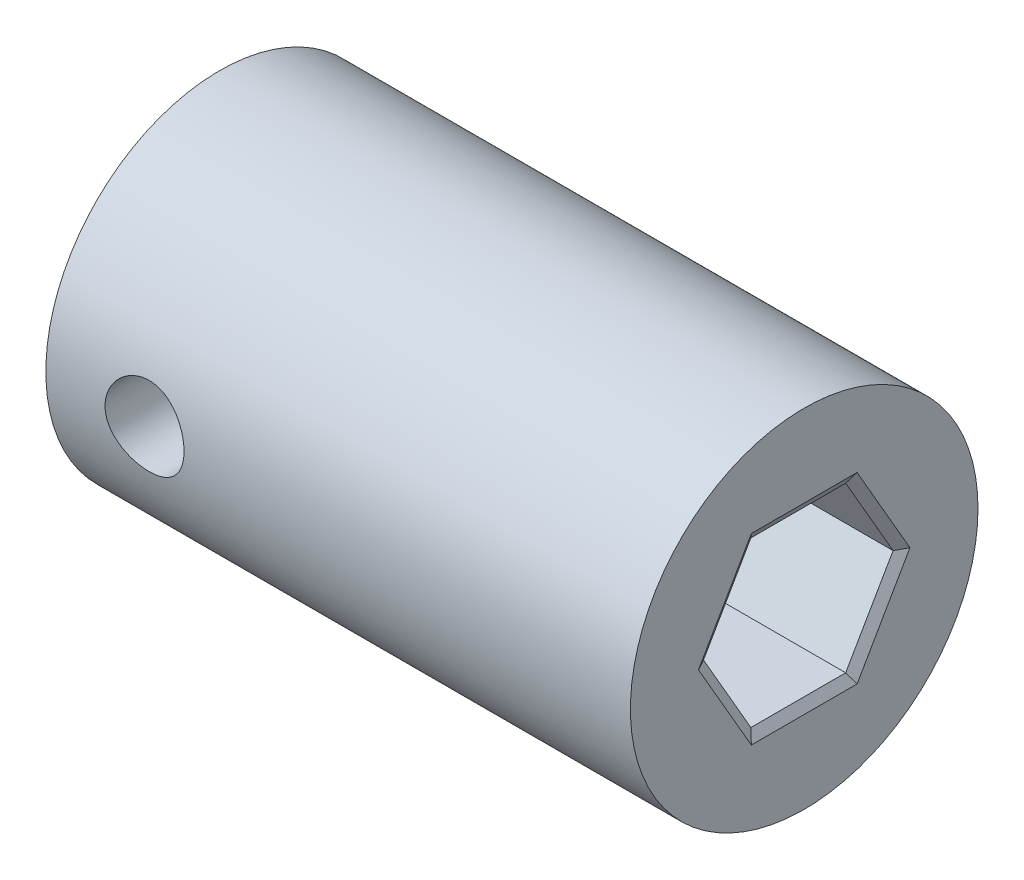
from build123d import *

# Parameters (mm, degrees)
SKETCH1_R               = 11
SKETCH1_R_2             = 3.9
BOSS_EXTRUDE1_DEPTH     = 37
CHAMFER2_SIZE           = 1.2
CHAMFER2_SIZE2          = 0.749843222
CUT_EXTRUDE1_START      = 20
CUT_EXTRUDE1_DEPTH      = 17
CHAMFER3_SIZE           = 0.6
CHAMFER3_SIZE2          = 0.374921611
CUT_EXTRUDE2_DEPTH      = 41.137264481
CUT_EXTRUDE2_DEPTH_BACK = 41.137264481
SKETCH2_R               = 2.5


with BuildPart() as part:
    # Sketch1 → Boss-Extrude1 (new body)
    with BuildSketch(Plane(origin=(0, 0, 0), x_dir=(0, 0, -1), z_dir=(1, 0, 0))):
        Circle(SKETCH1_R)
        Circle(SKETCH1_R_2, mode=Mode.SUBTRACT)
    extrude(amount=BOSS_EXTRUDE1_DEPTH)

    # Chamfer2
    chamfer2_edges = [part.edges().sort_by_distance(p)[0] for p in [
        (0, 0, 3.9),
    ]]
    chamfer2_side = [part.faces().sort_by_distance(p)[0] for p in [
        (18.5, 0, 3.9),
    ]]
    chamfer(chamfer2_edges, length=CHAMFER2_SIZE, length2=CHAMFER2_SIZE2, reference=chamfer2_side[0])

    # Sketch1_6 → Cut-Extrude1 (cut)
    with BuildSketch(Plane(origin=(0, 0, 0), x_dir=(0, 0, -1), z_dir=(1, 0, 0)).offset(CUT_EXTRUDE1_START)):
        Polygon((3, 5.196152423), (-3, 5.196152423), (-6, 0), (-3, -5.196152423), (3, -5.196152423), (6, 0), align=None)
    extrude(amount=CUT_EXTRUDE1_DEPTH, mode=Mode.SUBTRACT)

    # Chamfer3
    chamfer3_edges = [part.edges().sort_by_distance(p)[0] for p in [
        (37, -2.598076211, -4.5),
        (37, 2.598076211, -4.5),
        (37, 5.196152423, 0),
        (37, 2.598076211, 4.5),
        (37, -2.598076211, 4.5),
        (37, -5.196152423, 0),
    ]]
    chamfer3_side = [part.faces().sort_by_distance(p)[0] for p in [
        (37, 0, 10.688873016),
    ]]
    chamfer(chamfer3_edges, length=CHAMFER3_SIZE, length2=CHAMFER3_SIZE2, reference=chamfer3_side[0])

    # Sketch2 → Cut-Extrude2 (cut, two sides: drawn at the far end of the back side and taken through both)
    with BuildSketch(Plane.XY.offset(-CUT_EXTRUDE2_DEPTH_BACK)):
        with Locations((6.24464656, 0)):
            Circle(SKETCH2_R)
    extrude(amount=CUT_EXTRUDE2_DEPTH + CUT_EXTRUDE2_DEPTH_BACK, mode=Mode.SUBTRACT)


solid = part.part
